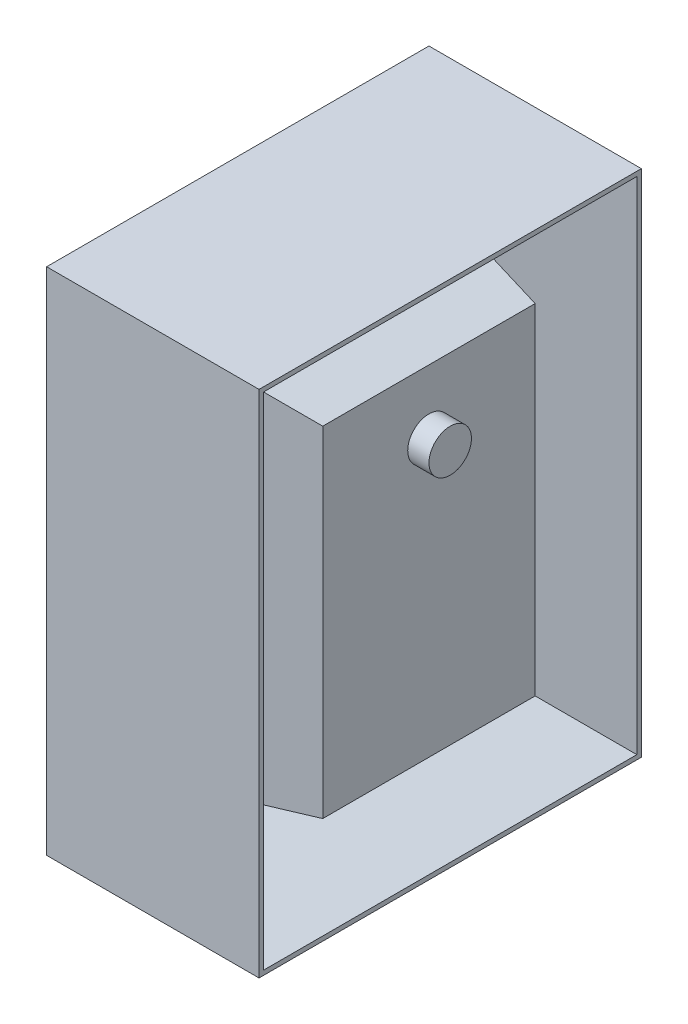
from build123d import *

# Parameters (mm, degrees)
ESQUISSE1_W        = 90
ESQUISSE1_H        = 120
BOSS_EXTRU_1_DEPTH = 5
ESQUISSE2_W        = 90
ESQUISSE2_H        = 120
ESQUISSE2_W_2      = 72
ESQUISSE2_H_2      = 102
BOSS_EXTRU_2_DEPTH = 45
ESQUISSE3_W        = 50
ESQUISSE3_H        = 80
BOSS_EXTRU_3_DEPTH = 40
D_POUILLE1_ANGLE   = 10
D_POUILLE2_ANGLE   = 10
ESQUISSE4_R        = 5
BOSS_EXTRU_4_DEPTH = 5


with BuildPart() as part:
    # Esquisse1 → Boss.-Extru.1 (new body)
    with BuildSketch(Plane(origin=(0, 0, 0), x_dir=(0, 0, -1), z_dir=(1, 0, 0))):
        with Locations((-45, 60)):
            Rectangle(ESQUISSE1_W, ESQUISSE1_H)
    extrude(amount=BOSS_EXTRU_1_DEPTH)

    # Esquisse2 → Boss.-Extru.2 (add)
    with BuildSketch(Plane(origin=(5, 0, 0), x_dir=(0, 0, -1), z_dir=(1, 0, 0))):
        with Locations((-45, 60)):
            Rectangle(ESQUISSE2_W, ESQUISSE2_H)
        with Locations((-45, 60)):
            Rectangle(ESQUISSE2_W_2, ESQUISSE2_H_2, mode=Mode.SUBTRACT)
    extrude(amount=BOSS_EXTRU_2_DEPTH)

    # Esquisse3 → Boss.-Extru.3 (add)
    with BuildSketch(Plane(origin=(5, 0, 0), x_dir=(0, 0, -1), z_dir=(1, 0, 0))):
        with Locations((-45, 60)):
            Rectangle(ESQUISSE3_W, ESQUISSE3_H)
    extrude(amount=BOSS_EXTRU_3_DEPTH)

    # D_pouille1
    d_pouille1_faces = [part.faces().sort_by_distance(p)[0] for p in [
        (25, 100, 45),
        (25, 60, 20),
        (25, 20, 45),
        (25, 60, 70),
    ]]
    draft(d_pouille1_faces, Plane(origin=(45, 0, 0), x_dir=(0, 0, 1), z_dir=(1, 0, 0)), D_POUILLE1_ANGLE)

    # D_pouille2
    d_pouille2_faces = [part.faces().sort_by_distance(p)[0] for p in [
        (27.5, 9, 45),
        (27.5, 60, 9),
        (27.5, 111, 45),
        (27.5, 60, 81),
    ]]
    draft(d_pouille2_faces, Plane(origin=(5, 0, 0), x_dir=(0, 0, 1), z_dir=(1, 0, 0)), D_POUILLE2_ANGLE)

    # Esquisse4 → Boss.-Extru.4 (add)
    with BuildSketch(Plane(origin=(45, 0, 0), x_dir=(0, 0, -1), z_dir=(1, 0, 0))):
        with Locations(Location((-45, 85, 0), (0, 0, 180))):
            Circle(ESQUISSE4_R)
    extrude(amount=BOSS_EXTRU_4_DEPTH)


solid = part.part
